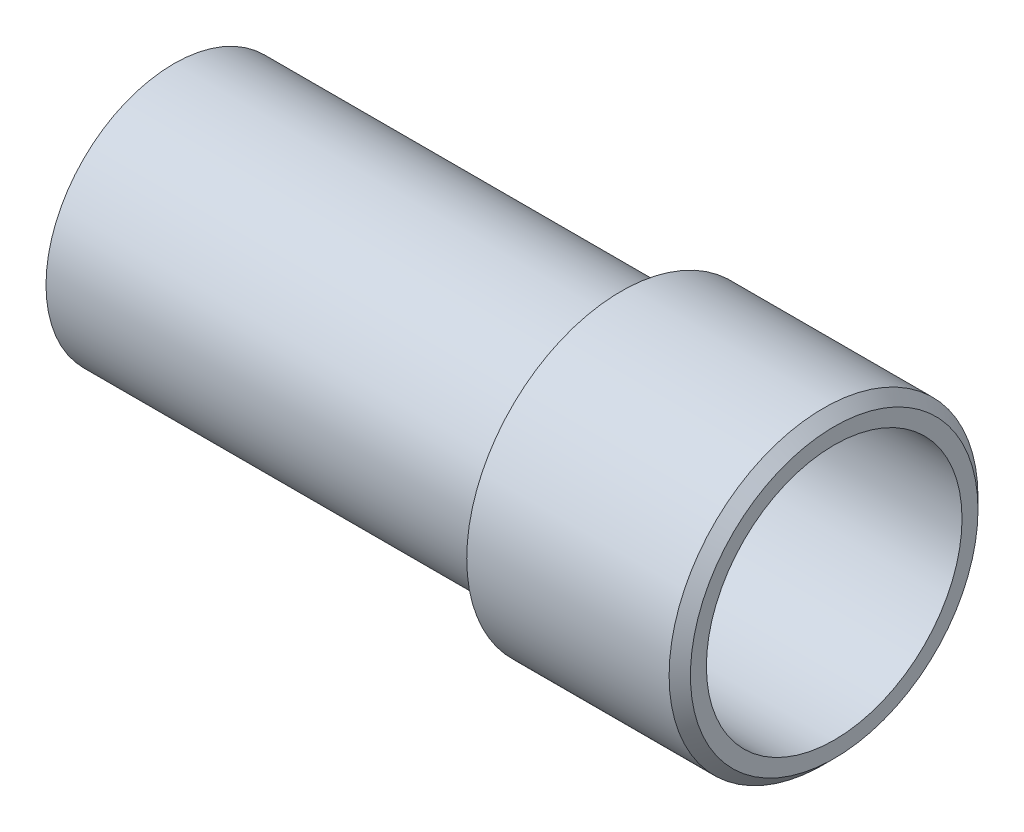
ISO-10303-21;
HEADER;
FILE_DESCRIPTION(('STEP AP214'),'2;1');
FILE_NAME('part.step','',(''),(''),'','','');
FILE_SCHEMA(('AUTOMOTIVE_DESIGN { 1 0 10303 214 1 1 1 1 }'));
ENDSEC;
DATA;
#1=APPLICATION_CONTEXT('core data for automotive mechanical design processes');
#2=APPLICATION_PROTOCOL_DEFINITION('international standard','automotive_design',2000,#1);
#3=PRODUCT_CONTEXT('',#1,'mechanical');
#4=PRODUCT('Part','Part','',(#3));
#5=PRODUCT_RELATED_PRODUCT_CATEGORY('part','',(#4));
#6=PRODUCT_DEFINITION_FORMATION('','',#4);
#7=PRODUCT_DEFINITION_CONTEXT('part definition',#1,'design');
#8=PRODUCT_DEFINITION('design','',#6,#7);
#9=PRODUCT_DEFINITION_SHAPE('','',#8);
#10=(LENGTH_UNIT() NAMED_UNIT(*) SI_UNIT(.MILLI.,.METRE.));
#11=(NAMED_UNIT(*) PLANE_ANGLE_UNIT() SI_UNIT($,.RADIAN.));
#12=(NAMED_UNIT(*) SI_UNIT($,.STERADIAN.) SOLID_ANGLE_UNIT());
#13=UNCERTAINTY_MEASURE_WITH_UNIT(LENGTH_MEASURE(1.E-05),#10,'distance_accuracy_value','');
#14=(GEOMETRIC_REPRESENTATION_CONTEXT(3) GLOBAL_UNCERTAINTY_ASSIGNED_CONTEXT((#13)) GLOBAL_UNIT_ASSIGNED_CONTEXT((#10,
#11,#12)) REPRESENTATION_CONTEXT('',''));
#15=CARTESIAN_POINT('',(0.,0.,0.));
#16=DIRECTION('',(0.,0.,1.));
#17=DIRECTION('',(1.,0.,0.));
#18=AXIS2_PLACEMENT_3D('',#15,#16,#17);
#19=CARTESIAN_POINT('',(-31.,0.,0.));
#20=DIRECTION('',(1.,0.,0.));
#21=DIRECTION('',(0.,0.,-1.));
#22=AXIS2_PLACEMENT_3D('',#19,#20,#21);
#23=CYLINDRICAL_SURFACE('',#22,6.);
#24=CARTESIAN_POINT('',(-31.,0.,0.));
#25=DIRECTION('',(-1.,0.,0.));
#26=DIRECTION('',(0.,0.,1.));
#27=AXIS2_PLACEMENT_3D('',#24,#25,#26);
#28=CIRCLE('',#27,6.);
#29=CARTESIAN_POINT('',(-31.,0.,-6.));
#30=VERTEX_POINT('',#29);
#31=EDGE_CURVE('E11',#30,#30,#28,.T.);
#32=CARTESIAN_POINT('',(-10.,0.,0.));
#33=DIRECTION('',(-1.,0.,0.));
#34=DIRECTION('',(0.,0.,1.));
#35=AXIS2_PLACEMENT_3D('',#32,#33,#34);
#36=CIRCLE('',#35,6.);
#37=CARTESIAN_POINT('',(-10.,0.,-6.));
#38=VERTEX_POINT('',#37);
#39=EDGE_CURVE('E47',#38,#38,#36,.T.);
#40=CARTESIAN_POINT('',(-31.,0.,-6.));
#41=CARTESIAN_POINT('',(-30.78125,0.,-6.));
#42=CARTESIAN_POINT('',(-30.5625,0.,-6.));
#43=CARTESIAN_POINT('',(-30.125,0.,-6.));
#44=CARTESIAN_POINT('',(-29.90625,0.,-6.));
#45=CARTESIAN_POINT('',(-29.46875,0.,-6.));
#46=CARTESIAN_POINT('',(-29.25,0.,-6.));
#47=CARTESIAN_POINT('',(-28.8125,0.,-6.));
#48=CARTESIAN_POINT('',(-28.59375,0.,-6.));
#49=CARTESIAN_POINT('',(-28.15625,0.,-6.));
#50=CARTESIAN_POINT('',(-27.9375,0.,-6.));
#51=CARTESIAN_POINT('',(-27.5,0.,-6.));
#52=CARTESIAN_POINT('',(-27.28125,0.,-6.));
#53=CARTESIAN_POINT('',(-26.84375,0.,-6.));
#54=CARTESIAN_POINT('',(-26.625,0.,-6.));
#55=CARTESIAN_POINT('',(-26.1875,0.,-6.));
#56=CARTESIAN_POINT('',(-25.96875,0.,-6.));
#57=CARTESIAN_POINT('',(-25.53125,0.,-6.));
#58=CARTESIAN_POINT('',(-25.3125,0.,-6.));
#59=CARTESIAN_POINT('',(-24.875,0.,-6.));
#60=CARTESIAN_POINT('',(-24.65625,0.,-6.));
#61=CARTESIAN_POINT('',(-24.21875,0.,-6.));
#62=CARTESIAN_POINT('',(-24.,0.,-6.));
#63=CARTESIAN_POINT('',(-23.5625,0.,-6.));
#64=CARTESIAN_POINT('',(-23.34375,0.,-6.));
#65=CARTESIAN_POINT('',(-22.90625,0.,-6.));
#66=CARTESIAN_POINT('',(-22.6875,0.,-6.));
#67=CARTESIAN_POINT('',(-22.25,0.,-6.));
#68=CARTESIAN_POINT('',(-22.03125,0.,-6.));
#69=CARTESIAN_POINT('',(-21.59375,0.,-6.));
#70=CARTESIAN_POINT('',(-21.375,0.,-6.));
#71=CARTESIAN_POINT('',(-20.9375,0.,-6.));
#72=CARTESIAN_POINT('',(-20.71875,0.,-6.));
#73=CARTESIAN_POINT('',(-20.28125,0.,-6.));
#74=CARTESIAN_POINT('',(-20.0625,0.,-6.));
#75=CARTESIAN_POINT('',(-19.625,0.,-6.));
#76=CARTESIAN_POINT('',(-19.40625,0.,-6.));
#77=CARTESIAN_POINT('',(-18.96875,0.,-6.));
#78=CARTESIAN_POINT('',(-18.75,0.,-6.));
#79=CARTESIAN_POINT('',(-18.3125,0.,-6.));
#80=CARTESIAN_POINT('',(-18.09375,0.,-6.));
#81=CARTESIAN_POINT('',(-17.65625,0.,-6.));
#82=CARTESIAN_POINT('',(-17.4375,0.,-6.));
#83=CARTESIAN_POINT('',(-17.,0.,-6.));
#84=CARTESIAN_POINT('',(-16.78125,0.,-6.));
#85=CARTESIAN_POINT('',(-16.34375,0.,-6.));
#86=CARTESIAN_POINT('',(-16.125,0.,-6.));
#87=CARTESIAN_POINT('',(-15.6875,0.,-6.));
#88=CARTESIAN_POINT('',(-15.46875,0.,-6.));
#89=CARTESIAN_POINT('',(-15.03125,0.,-6.));
#90=CARTESIAN_POINT('',(-14.8125,0.,-6.));
#91=CARTESIAN_POINT('',(-14.375,0.,-6.));
#92=CARTESIAN_POINT('',(-14.15625,0.,-6.));
#93=CARTESIAN_POINT('',(-13.71875,0.,-6.));
#94=CARTESIAN_POINT('',(-13.5,0.,-6.));
#95=CARTESIAN_POINT('',(-13.0625,0.,-6.));
#96=CARTESIAN_POINT('',(-12.84375,0.,-6.));
#97=CARTESIAN_POINT('',(-12.40625,0.,-6.));
#98=CARTESIAN_POINT('',(-12.1875,0.,-6.));
#99=CARTESIAN_POINT('',(-11.75,0.,-6.));
#100=CARTESIAN_POINT('',(-11.53125,0.,-6.));
#101=CARTESIAN_POINT('',(-11.09375,0.,-6.));
#102=CARTESIAN_POINT('',(-10.875,0.,-6.));
#103=CARTESIAN_POINT('',(-10.4375,0.,-6.));
#104=CARTESIAN_POINT('',(-10.21875,0.,-6.));
#105=CARTESIAN_POINT('',(-10.,0.,-6.));
#106=B_SPLINE_CURVE_WITH_KNOTS('',3,(#40,#41,#42,#43,#44,#45,#46,#47,#48,#49,#50,#51,#52,#53,
#54,#55,#56,#57,#58,#59,#60,#61,#62,#63,#64,#65,#66,#67,#68,#69,#70,#71,#72,#73,#74,#75,#76,#77,
#78,#79,#80,#81,#82,#83,#84,#85,#86,#87,#88,#89,#90,#91,#92,#93,#94,#95,#96,#97,#98,#99,#100,
#101,#102,#103,#104,#105),.UNSPECIFIED.,.F.,.F.,(4,2,2,2,2,2,2,2,2,2,2,2,2,2,2,2,2,2,2,2,2,2,2,
2,2,2,2,2,2,2,2,2,4),(0.,0.656249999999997,1.3125,1.96875,2.625,3.28125,3.9375,4.59375,5.25,
5.90625,6.5625,7.21875,7.875,8.53125,9.1875,9.84374999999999,10.5,11.15625,11.8125,12.46875,
13.125,13.78125,14.4375,15.09375,15.75,16.40625,17.0625,17.71875,18.375,19.03125,19.6875,
20.34375,21.),.UNSPECIFIED.);
#107=EDGE_CURVE('BSEAM40',#30,#38,#106,.T.);
#108=ORIENTED_EDGE('',*,*,#31,.F.);
#109=ORIENTED_EDGE('',*,*,#39,.T.);
#110=ORIENTED_EDGE('',*,*,#107,.T.);
#111=ORIENTED_EDGE('',*,*,#107,.F.);
#112=EDGE_LOOP('',(#108,#110,#109,#111));
#113=FACE_BOUND('',#112,.T.);
#114=ADVANCED_FACE('F40',(#113),#23,.T.);
#115=CARTESIAN_POINT('',(-31.,0.,0.));
#116=DIRECTION('',(-1.,0.,0.));
#117=DIRECTION('',(0.,0.,1.));
#118=AXIS2_PLACEMENT_3D('',#115,#116,#117);
#119=PLANE('',#118);
#120=CARTESIAN_POINT('',(-31.,0.,0.));
#121=DIRECTION('',(-1.,0.,0.));
#122=DIRECTION('',(0.,0.,1.));
#123=AXIS2_PLACEMENT_3D('',#120,#121,#122);
#124=CIRCLE('',#123,2.5);
#125=CARTESIAN_POINT('',(-31.,0.,-2.5));
#126=VERTEX_POINT('',#125);
#127=EDGE_CURVE('E52',#126,#126,#124,.T.);
#128=ORIENTED_EDGE('',*,*,#127,.F.);
#129=EDGE_LOOP('',(#128));
#130=FACE_BOUND('',#129,.T.);
#131=ORIENTED_EDGE('',*,*,#31,.T.);
#132=EDGE_LOOP('',(#131));
#133=FACE_BOUND('',#132,.T.);
#134=ADVANCED_FACE('F69',(#130,#133),#119,.T.);
#135=CARTESIAN_POINT('',(-10.,0.,0.));
#136=DIRECTION('',(-1.,0.,0.));
#137=DIRECTION('',(0.,0.,1.));
#138=AXIS2_PLACEMENT_3D('',#135,#136,#137);
#139=PLANE('',#138);
#140=CARTESIAN_POINT('',(-10.,0.,0.));
#141=DIRECTION('',(-1.,0.,0.));
#142=DIRECTION('',(0.,0.,1.));
#143=AXIS2_PLACEMENT_3D('',#140,#141,#142);
#144=CIRCLE('',#143,2.5);
#145=CARTESIAN_POINT('',(-10.,0.,-2.5));
#146=VERTEX_POINT('',#145);
#147=EDGE_CURVE('E43',#146,#146,#144,.T.);
#148=ORIENTED_EDGE('',*,*,#147,.T.);
#149=EDGE_LOOP('',(#148));
#150=FACE_BOUND('',#149,.T.);
#151=ORIENTED_EDGE('',*,*,#39,.F.);
#152=EDGE_LOOP('',(#151));
#153=FACE_BOUND('',#152,.T.);
#154=ADVANCED_FACE('F60',(#150,#153),#139,.F.);
#155=CARTESIAN_POINT('',(-40.,0.,0.));
#156=DIRECTION('',(1.,0.,0.));
#157=DIRECTION('',(0.,0.,-1.));
#158=AXIS2_PLACEMENT_3D('',#155,#156,#157);
#159=CYLINDRICAL_SURFACE('',#158,2.5);
#160=CARTESIAN_POINT('',(-31.,0.,-2.5));
#161=CARTESIAN_POINT('',(-30.78125,0.,-2.5));
#162=CARTESIAN_POINT('',(-30.5625,0.,-2.5));
#163=CARTESIAN_POINT('',(-30.125,0.,-2.5));
#164=CARTESIAN_POINT('',(-29.90625,0.,-2.5));
#165=CARTESIAN_POINT('',(-29.46875,0.,-2.5));
#166=CARTESIAN_POINT('',(-29.25,0.,-2.5));
#167=CARTESIAN_POINT('',(-28.8125,0.,-2.5));
#168=CARTESIAN_POINT('',(-28.59375,0.,-2.5));
#169=CARTESIAN_POINT('',(-28.15625,0.,-2.5));
#170=CARTESIAN_POINT('',(-27.9375,0.,-2.5));
#171=CARTESIAN_POINT('',(-27.5,0.,-2.5));
#172=CARTESIAN_POINT('',(-27.28125,0.,-2.5));
#173=CARTESIAN_POINT('',(-26.84375,0.,-2.5));
#174=CARTESIAN_POINT('',(-26.625,0.,-2.5));
#175=CARTESIAN_POINT('',(-26.1875,0.,-2.5));
#176=CARTESIAN_POINT('',(-25.96875,0.,-2.5));
#177=CARTESIAN_POINT('',(-25.53125,0.,-2.5));
#178=CARTESIAN_POINT('',(-25.3125,0.,-2.5));
#179=CARTESIAN_POINT('',(-24.875,0.,-2.5));
#180=CARTESIAN_POINT('',(-24.65625,0.,-2.5));
#181=CARTESIAN_POINT('',(-24.21875,0.,-2.5));
#182=CARTESIAN_POINT('',(-24.,0.,-2.5));
#183=CARTESIAN_POINT('',(-23.5625,0.,-2.5));
#184=CARTESIAN_POINT('',(-23.34375,0.,-2.5));
#185=CARTESIAN_POINT('',(-22.90625,0.,-2.5));
#186=CARTESIAN_POINT('',(-22.6875,0.,-2.5));
#187=CARTESIAN_POINT('',(-22.25,0.,-2.5));
#188=CARTESIAN_POINT('',(-22.03125,0.,-2.5));
#189=CARTESIAN_POINT('',(-21.59375,0.,-2.5));
#190=CARTESIAN_POINT('',(-21.375,0.,-2.5));
#191=CARTESIAN_POINT('',(-20.9375,0.,-2.5));
#192=CARTESIAN_POINT('',(-20.71875,0.,-2.5));
#193=CARTESIAN_POINT('',(-20.28125,0.,-2.5));
#194=CARTESIAN_POINT('',(-20.0625,0.,-2.5));
#195=CARTESIAN_POINT('',(-19.625,0.,-2.5));
#196=CARTESIAN_POINT('',(-19.40625,0.,-2.5));
#197=CARTESIAN_POINT('',(-18.96875,0.,-2.5));
#198=CARTESIAN_POINT('',(-18.75,0.,-2.5));
#199=CARTESIAN_POINT('',(-18.3125,0.,-2.5));
#200=CARTESIAN_POINT('',(-18.09375,0.,-2.5));
#201=CARTESIAN_POINT('',(-17.65625,0.,-2.5));
#202=CARTESIAN_POINT('',(-17.4375,0.,-2.5));
#203=CARTESIAN_POINT('',(-17.,0.,-2.5));
#204=CARTESIAN_POINT('',(-16.78125,0.,-2.5));
#205=CARTESIAN_POINT('',(-16.34375,0.,-2.5));
#206=CARTESIAN_POINT('',(-16.125,0.,-2.5));
#207=CARTESIAN_POINT('',(-15.6875,0.,-2.5));
#208=CARTESIAN_POINT('',(-15.46875,0.,-2.5));
#209=CARTESIAN_POINT('',(-15.03125,0.,-2.5));
#210=CARTESIAN_POINT('',(-14.8125,0.,-2.5));
#211=CARTESIAN_POINT('',(-14.375,0.,-2.5));
#212=CARTESIAN_POINT('',(-14.15625,0.,-2.5));
#213=CARTESIAN_POINT('',(-13.71875,0.,-2.5));
#214=CARTESIAN_POINT('',(-13.5,0.,-2.5));
#215=CARTESIAN_POINT('',(-13.0625,0.,-2.5));
#216=CARTESIAN_POINT('',(-12.84375,0.,-2.5));
#217=CARTESIAN_POINT('',(-12.40625,0.,-2.5));
#218=CARTESIAN_POINT('',(-12.1875,0.,-2.5));
#219=CARTESIAN_POINT('',(-11.75,0.,-2.5));
#220=CARTESIAN_POINT('',(-11.53125,0.,-2.5));
#221=CARTESIAN_POINT('',(-11.09375,0.,-2.5));
#222=CARTESIAN_POINT('',(-10.875,0.,-2.5));
#223=CARTESIAN_POINT('',(-10.4375,0.,-2.5));
#224=CARTESIAN_POINT('',(-10.21875,0.,-2.5));
#225=CARTESIAN_POINT('',(-10.,0.,-2.5));
#226=B_SPLINE_CURVE_WITH_KNOTS('',3,(#160,#161,#162,#163,#164,#165,#166,#167,#168,#169,#170,
#171,#172,#173,#174,#175,#176,#177,#178,#179,#180,#181,#182,#183,#184,#185,#186,#187,#188,#189,
#190,#191,#192,#193,#194,#195,#196,#197,#198,#199,#200,#201,#202,#203,#204,#205,#206,#207,#208,
#209,#210,#211,#212,#213,#214,#215,#216,#217,#218,#219,#220,#221,#222,#223,#224,#225),
.UNSPECIFIED.,.F.,.F.,(4,2,2,2,2,2,2,2,2,2,2,2,2,2,2,2,2,2,2,2,2,2,2,2,2,2,2,2,2,2,2,2,4),(0.,
0.656250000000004,1.3125,1.96875,2.625,3.28125,3.9375,4.59375,5.25,5.90625,6.5625,7.21875,7.875,
8.53125,9.1875,9.84375,10.5,11.15625,11.8125,12.46875,13.125,13.78125,14.4375,15.09375,15.75,
16.40625,17.0625,17.71875,18.375,19.03125,19.6875,20.34375,21.),.UNSPECIFIED.);
#227=EDGE_CURVE('BSEAM63',#126,#146,#226,.T.);
#228=ORIENTED_EDGE('',*,*,#127,.T.);
#229=ORIENTED_EDGE('',*,*,#147,.F.);
#230=ORIENTED_EDGE('',*,*,#227,.T.);
#231=ORIENTED_EDGE('',*,*,#227,.F.);
#232=EDGE_LOOP('',(#228,#230,#229,#231));
#233=FACE_BOUND('',#232,.T.);
#234=ADVANCED_FACE('F63',(#233),#159,.F.);
#235=CLOSED_SHELL('',(#114,#134,#154,#234));
#236=MANIFOLD_SOLID_BREP('B2',#235);
#237=CARTESIAN_POINT('',(-10.,0.,0.));
#238=DIRECTION('',(1.,0.,0.));
#239=DIRECTION('',(0.,0.,-1.));
#240=AXIS2_PLACEMENT_3D('',#237,#238,#239);
#241=CYLINDRICAL_SURFACE('',#240,7.25);
#242=CARTESIAN_POINT('',(-0.5,0.,0.));
#243=DIRECTION('',(1.,0.,0.));
#244=DIRECTION('',(0.,0.,-1.));
#245=AXIS2_PLACEMENT_3D('',#242,#243,#244);
#246=CIRCLE('',#245,7.25);
#247=CARTESIAN_POINT('',(-0.5,0.,-7.25));
#248=VERTEX_POINT('',#247);
#249=EDGE_CURVE('E39',#248,#248,#246,.F.);
#250=ORIENTED_EDGE('',*,*,#249,.T.);
#251=EDGE_LOOP('',(#250));
#252=FACE_BOUND('',#251,.T.);
#253=CARTESIAN_POINT('',(-10.,0.,0.));
#254=DIRECTION('',(1.,0.,0.));
#255=DIRECTION('',(0.,0.,-1.));
#256=AXIS2_PLACEMENT_3D('',#253,#254,#255);
#257=CIRCLE('',#256,7.25);
#258=CARTESIAN_POINT('',(-10.,0.,-7.25));
#259=VERTEX_POINT('',#258);
#260=EDGE_CURVE('E112',#259,#259,#257,.T.);
#261=ORIENTED_EDGE('',*,*,#260,.T.);
#262=EDGE_LOOP('',(#261));
#263=FACE_BOUND('',#262,.T.);
#264=ADVANCED_FACE('F101',(#252,#263),#241,.T.);
#265=CARTESIAN_POINT('',(-10.,0.,0.));
#266=DIRECTION('',(1.,0.,0.));
#267=DIRECTION('',(0.,0.,-1.));
#268=AXIS2_PLACEMENT_3D('',#265,#266,#267);
#269=PLANE('',#268);
#270=CARTESIAN_POINT('',(-10.,0.,0.));
#271=DIRECTION('',(1.,0.,0.));
#272=DIRECTION('',(0.,0.,-1.));
#273=AXIS2_PLACEMENT_3D('',#270,#271,#272);
#274=CIRCLE('',#273,6.);
#275=CARTESIAN_POINT('',(-10.,0.,-6.));
#276=VERTEX_POINT('',#275);
#277=EDGE_CURVE('E116',#276,#276,#274,.T.);
#278=ORIENTED_EDGE('',*,*,#277,.T.);
#279=EDGE_LOOP('',(#278));
#280=FACE_BOUND('',#279,.T.);
#281=ORIENTED_EDGE('',*,*,#260,.F.);
#282=EDGE_LOOP('',(#281));
#283=FACE_BOUND('',#282,.T.);
#284=ADVANCED_FACE('F125',(#280,#283),#269,.F.);
#285=CARTESIAN_POINT('',(0.,0.,0.));
#286=DIRECTION('',(1.,0.,0.));
#287=DIRECTION('',(0.,0.,-1.));
#288=AXIS2_PLACEMENT_3D('',#285,#286,#287);
#289=PLANE('',#288);
#290=CARTESIAN_POINT('',(0.,0.,0.));
#291=DIRECTION('',(1.,0.,0.));
#292=DIRECTION('',(0.,0.,-1.));
#293=AXIS2_PLACEMENT_3D('',#290,#291,#292);
#294=CIRCLE('',#293,6.75);
#295=CARTESIAN_POINT('',(0.,0.,-6.75));
#296=VERTEX_POINT('',#295);
#297=EDGE_CURVE('E108',#296,#296,#294,.T.);
#298=ORIENTED_EDGE('',*,*,#297,.T.);
#299=EDGE_LOOP('',(#298));
#300=FACE_BOUND('',#299,.T.);
#301=CARTESIAN_POINT('',(0.,0.,0.));
#302=DIRECTION('',(1.,0.,0.));
#303=DIRECTION('',(0.,0.,-1.));
#304=AXIS2_PLACEMENT_3D('',#301,#302,#303);
#305=CIRCLE('',#304,6.);
#306=CARTESIAN_POINT('',(0.,0.,-6.));
#307=VERTEX_POINT('',#306);
#308=EDGE_CURVE('E119',#307,#307,#305,.T.);
#309=ORIENTED_EDGE('',*,*,#308,.F.);
#310=EDGE_LOOP('',(#309));
#311=FACE_BOUND('',#310,.T.);
#312=ADVANCED_FACE('F131',(#300,#311),#289,.T.);
#313=CARTESIAN_POINT('',(-10.,0.,0.));
#314=DIRECTION('',(1.,0.,0.));
#315=DIRECTION('',(0.,0.,-1.));
#316=AXIS2_PLACEMENT_3D('',#313,#314,#315);
#317=CYLINDRICAL_SURFACE('',#316,6.);
#318=ORIENTED_EDGE('',*,*,#277,.F.);
#319=EDGE_LOOP('',(#318));
#320=FACE_BOUND('',#319,.T.);
#321=ORIENTED_EDGE('',*,*,#308,.T.);
#322=EDGE_LOOP('',(#321));
#323=FACE_BOUND('',#322,.T.);
#324=ADVANCED_FACE('F128',(#320,#323),#317,.F.);
#325=CARTESIAN_POINT('',(0.,0.,0.));
#326=DIRECTION('',(-1.,0.,0.));
#327=DIRECTION('',(0.,0.,1.));
#328=AXIS2_PLACEMENT_3D('',#325,#326,#327);
#329=CONICAL_SURFACE('',#328,6.75,0.785398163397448);
#330=ORIENTED_EDGE('',*,*,#249,.F.);
#331=EDGE_LOOP('',(#330));
#332=FACE_BOUND('',#331,.T.);
#333=ORIENTED_EDGE('',*,*,#297,.F.);
#334=EDGE_LOOP('',(#333));
#335=FACE_BOUND('',#334,.T.);
#336=ADVANCED_FACE('F103',(#332,#335),#329,.T.);
#337=CLOSED_SHELL('',(#264,#284,#312,#324,#336));
#338=MANIFOLD_SOLID_BREP('B6',#337);
#339=ADVANCED_BREP_SHAPE_REPRESENTATION('',(#18,#236,#338),#14);
#340=SHAPE_DEFINITION_REPRESENTATION(#9,#339);
ENDSEC;
END-ISO-10303-21;
